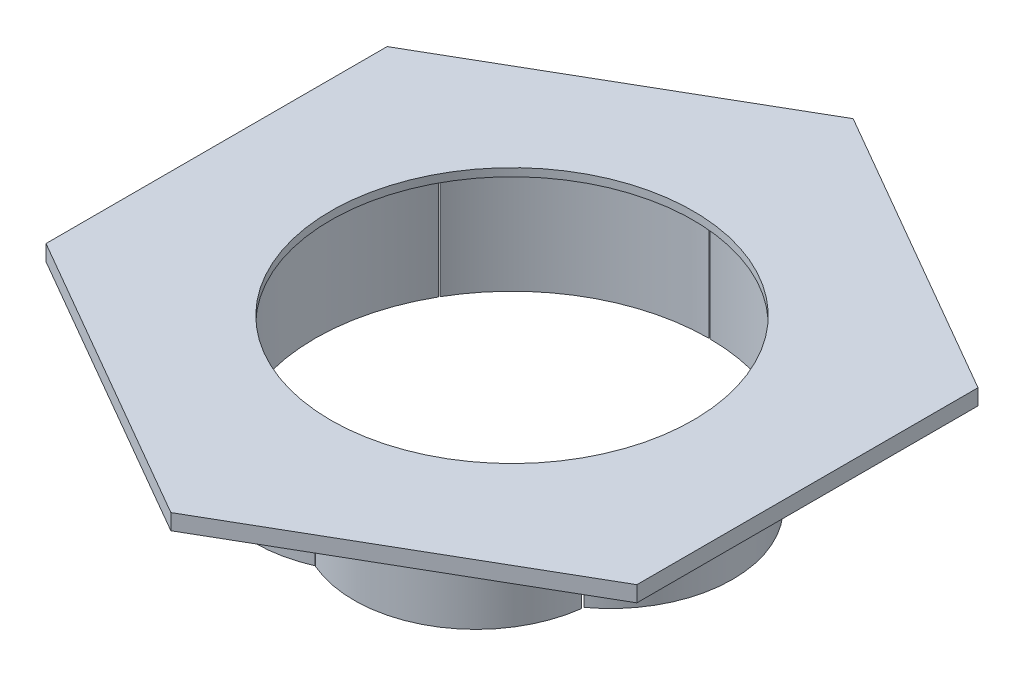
from build123d import *

# Parameters (mm, degrees)
SKETCH1_R           = 317.5
BOSS_EXTRUDE2_DEPTH = 25.4
BOSS_EXTRUDE4_START = 165.1
BOSS_EXTRUDE4_DEPTH = 165.1
BOSS_EXTRUDE5_START = 165.1
BOSS_EXTRUDE5_DEPTH = 165.1
BOSS_EXTRUDE6_START = 165.1
BOSS_EXTRUDE6_DEPTH = 165.1
BOSS_EXTRUDE7_START = 165.1
BOSS_EXTRUDE7_DEPTH = 165.1
BOSS_EXTRUDE8_START = -12.7
SKETCH12_R          = 317.5
SKETCH12_R_2        = 292.09999999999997
BOSS_EXTRUDE8_DEPTH = 12.7
SCALE1_SCALE        = 0.0394666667


with BuildPart() as part:
    # Sketch1 → Boss-Extrude2 (new body)
    with BuildSketch(Plane(origin=(0, 0, 0), x_dir=(1, 0, 0), z_dir=(0, 1, 0))):
        Polygon((-2.269e-14, 549.9099999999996), (-476.2360297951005, 274.9549999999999), (-476.2360297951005, -274.9549999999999), (-2.391e-14, -549.9099999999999), (476.2360297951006, -274.95500000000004), (476.23602979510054, 274.9549999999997), align=None)
        with Locations(Location((0, 0, 0), (0, 0, 270))):
            Circle(SKETCH1_R, mode=Mode.SUBTRACT)
    extrude(amount=BOSS_EXTRUDE2_DEPTH)

    # Sketch2 → Boss-Extrude4 (add)
    with BuildSketch(Plane.XZ.offset(BOSS_EXTRUDE4_START)):
        with BuildLine():
            ThreePointArc((-158.74999999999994, 274.96306570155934), (-82.17504682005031, 306.6814498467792), (0, 317.5))
            ThreePointArc((-2.842e-14, 317.49999999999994), (-90.04218115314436, 334.0134599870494), (-177.79999999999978, 307.95863358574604))
            Line((-177.8, 307.9586335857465), (-158.75, 274.96306570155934))
        make_face()
        with BuildLine():
            Line((-158.75, 274.96306570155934), (-177.8, 307.9586335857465))
            ThreePointArc((-177.7999999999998, 307.95863358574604), (-244.24305097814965, 244.9855462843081), (-274.9630657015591, 158.74999999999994))
            ThreePointArc((-274.96306570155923, 158.7500000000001), (-224.50640302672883, 224.50640302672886), (-158.74999999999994, 274.9630657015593))
        make_face()
        with BuildLine():
            ThreePointArc((-158.74999999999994, 274.96306570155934), (-82.17504682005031, 306.6814498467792), (0, 317.5))
            ThreePointArc((-2.842e-14, 317.49999999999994), (-90.04218115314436, 334.0134599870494), (-177.79999999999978, 307.95863358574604))
            Line((-177.8, 307.9586335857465), (-158.75, 274.96306570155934))
        make_face()
        with BuildLine():
            Line((-158.75, 274.96306570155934), (-177.8, 307.9586335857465))
            ThreePointArc((-177.7999999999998, 307.95863358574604), (-244.24305097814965, 244.9855462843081), (-274.9630657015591, 158.74999999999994))
            ThreePointArc((-274.96306570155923, 158.7500000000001), (-224.50640302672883, 224.50640302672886), (-158.74999999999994, 274.9630657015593))
        make_face()
        with BuildLine():
            ThreePointArc((355.5999999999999, 0), (334.28523213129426, 89.02791370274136), (274.9630657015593, 158.75000000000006))
            ThreePointArc((274.96306570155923, 158.75000000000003), (306.6814498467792, 82.17504682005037), (317.5, 0))
            Line((317.5, 1.3878e-13), (355.6, 1.4544e-13))
        make_face()
        with BuildLine():
            ThreePointArc((317.5, -7.777e-14), (306.6814498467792, -82.17504682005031), (274.96306570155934, -158.7499999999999))
            ThreePointArc((274.9630657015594, -158.74999999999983), (334.28523213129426, -89.02791370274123), (355.5999999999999, 0))
            Line((355.6, 1.4544e-13), (317.5, 1.3878e-13))
        make_face()
        with BuildLine():
            ThreePointArc((355.5999999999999, 0), (334.28523213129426, 89.02791370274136), (274.9630657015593, 158.75000000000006))
            ThreePointArc((274.96306570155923, 158.75000000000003), (306.6814498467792, 82.17504682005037), (317.5, 0))
            Line((317.5, 1.3878e-13), (355.6, 1.4544e-13))
        make_face()
        with BuildLine():
            ThreePointArc((317.5, -7.777e-14), (306.6814498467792, -82.17504682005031), (274.96306570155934, -158.7499999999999))
            ThreePointArc((274.9630657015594, -158.74999999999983), (334.28523213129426, -89.02791370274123), (355.5999999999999, 0))
            Line((355.6, 1.4544e-13), (317.5, 1.3878e-13))
        make_face()
        with BuildLine():
            ThreePointArc((-177.79999999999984, -307.95863358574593), (-90.04218115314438, -334.01345998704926), (-2.842e-14, -317.4999999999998))
            ThreePointArc((-5.832e-14, -317.5), (-82.17504682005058, -306.6814498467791), (-158.7500000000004, -274.96306570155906))
            Line((-158.75, -274.9630657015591), (-177.8, -307.95863358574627))
        make_face()
        with BuildLine():
            ThreePointArc((-158.7500000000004, -274.96306570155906), (-224.50640302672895, -224.50640302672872), (-274.96306570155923, -158.75000000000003))
            ThreePointArc((-274.96306570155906, -158.7499999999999), (-244.24305097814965, -244.98554628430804), (-177.79999999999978, -307.958633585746))
            Line((-177.8, -307.95863358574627), (-158.75, -274.9630657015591))
        make_face()
        with BuildLine():
            ThreePointArc((-177.79999999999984, -307.95863358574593), (-90.04218115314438, -334.01345998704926), (-2.842e-14, -317.4999999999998))
            ThreePointArc((-5.832e-14, -317.5), (-82.17504682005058, -306.6814498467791), (-158.7500000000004, -274.96306570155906))
            Line((-158.75, -274.9630657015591), (-177.8, -307.95863358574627))
        make_face()
        with BuildLine():
            ThreePointArc((-158.7500000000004, -274.96306570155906), (-224.50640302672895, -224.50640302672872), (-274.96306570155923, -158.75000000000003))
            ThreePointArc((-274.96306570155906, -158.7499999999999), (-244.24305097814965, -244.98554628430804), (-177.79999999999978, -307.958633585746))
            Line((-177.8, -307.95863358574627), (-158.75, -274.9630657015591))
        make_face()
    extrude(amount=-BOSS_EXTRUDE4_DEPTH)

    # Sketch3 → Boss-Extrude5 (add)
    with BuildSketch(Plane.XZ.offset(BOSS_EXTRUDE5_START)):
        with BuildLine():
            Line((1.125631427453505, 317.99352272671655), (1.125631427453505, 317.49800464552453))
            ThreePointArc((1.125631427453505, 317.49800464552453), (157.25837681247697, 275.81887702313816), (272.65220899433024, 162.68688616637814))
            Line((272.65220899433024, 162.68688616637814), (274.498918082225, 162.68688616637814))
            ThreePointArc((274.498918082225, 162.68688616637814), (176.61083575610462, 308.63406730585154), (1.125631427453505, 317.99352272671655))
        make_face()
    extrude(amount=-BOSS_EXTRUDE5_DEPTH)

    # Sketch9 → Boss-Extrude6 (add)
    with BuildSketch(Plane.XZ.offset(BOSS_EXTRUDE6_START)):
        with BuildLine():
            Line((-278.06735748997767, 156.4354762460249), (-276.7156277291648, 155.6750184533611))
            ThreePointArc((-276.7156277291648, 155.6750184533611), (-317.4985892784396, -0.9464703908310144), (-275.78257653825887, -157.32202794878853))
            Line((-275.78257653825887, -157.32202794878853), (-276.41233353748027, -157.68127706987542))
            ThreePointArc((-276.41233353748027, -157.68127706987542), (-355.59727142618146, -1.035751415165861), (-278.06735748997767, 156.4354762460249))
        make_face()
    extrude(amount=-BOSS_EXTRUDE6_DEPTH)

    # Sketch10 → Boss-Extrude7 (add)
    with BuildSketch(Plane.XZ.offset(BOSS_EXTRUDE7_START)):
        with BuildLine():
            ThreePointArc((1.0276418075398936, -317.9509528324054), (90.60244836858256, -333.9825921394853), (177.80000000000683, -307.95863358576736))
            Line((177.80000000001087, -307.958633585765), (158.75000000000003, -274.9630657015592))
            ThreePointArc((158.75000000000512, -274.96306570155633), (82.8906019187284, -306.4888221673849), (1.482053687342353, -317.49654095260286))
            Line((1.4820536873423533, -317.4965409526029), (1.0276418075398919, -317.9509528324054))
        make_face()
        with BuildLine():
            Line((158.75000000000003, -274.9630657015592), (177.80000000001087, -307.958633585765))
            ThreePointArc((177.80000000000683, -307.95863358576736), (244.1907850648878, -245.0657657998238), (274.94248018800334, -158.9403780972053))
            Line((274.9424801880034, -158.9403780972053), (274.9326905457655, -158.94037809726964))
            Line((274.9326905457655, -158.94037809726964), (274.85776909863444, -158.93223954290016))
            ThreePointArc((274.8577690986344, -158.93223954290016), (224.43197746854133, -224.58080392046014), (158.75000000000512, -274.96306570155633))
        make_face()
    extrude(amount=-BOSS_EXTRUDE7_DEPTH)

    # Sketch12 → Boss-Extrude8 (add)
    with BuildSketch(Plane(origin=(0, 25.4, 0), x_dir=(1, 0, 0), z_dir=(0, 1, 0)).offset(BOSS_EXTRUDE8_START)):
        with Locations(Location((0, 0, 0), (0, 0, 270))):
            Circle(SKETCH12_R)
        with Locations(Location((0, 0, 0), (0, 0, 270))):
            Circle(SKETCH12_R_2, mode=Mode.SUBTRACT)
    extrude(amount=BOSS_EXTRUDE8_DEPTH)


with BuildPart() as part_1:
    # Scale1: scaled about (-0.002119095, -26.157835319, -0.009749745)
    add(part.part.scale(SCALE1_SCALE).moved(Location((-0.00203546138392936, -25.125472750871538, -0.00936495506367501))))


solid = part_1.part
